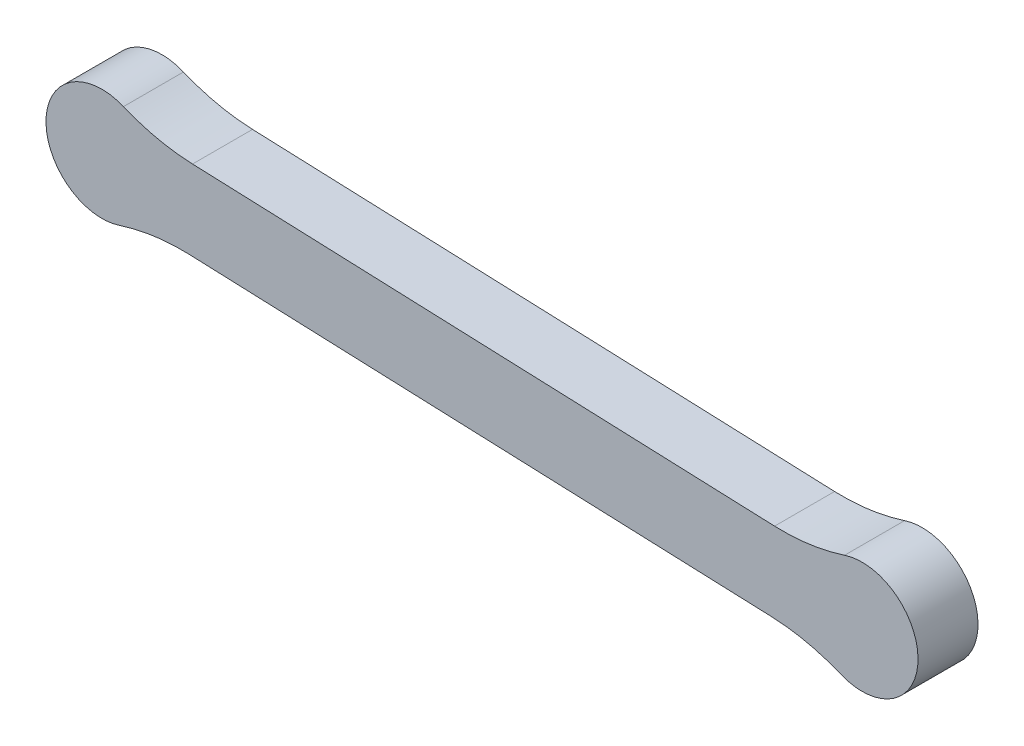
ISO-10303-21;
HEADER;
FILE_DESCRIPTION(('STEP AP214'),'2;1');
FILE_NAME('part.step','',(''),(''),'','','');
FILE_SCHEMA(('AUTOMOTIVE_DESIGN { 1 0 10303 214 1 1 1 1 }'));
ENDSEC;
DATA;
#1=APPLICATION_CONTEXT('core data for automotive mechanical design processes');
#2=APPLICATION_PROTOCOL_DEFINITION('international standard','automotive_design',2000,#1);
#3=PRODUCT_CONTEXT('',#1,'mechanical');
#4=PRODUCT('Part','Part','',(#3));
#5=PRODUCT_RELATED_PRODUCT_CATEGORY('part','',(#4));
#6=PRODUCT_DEFINITION_FORMATION('','',#4);
#7=PRODUCT_DEFINITION_CONTEXT('part definition',#1,'design');
#8=PRODUCT_DEFINITION('design','',#6,#7);
#9=PRODUCT_DEFINITION_SHAPE('','',#8);
#10=(LENGTH_UNIT() NAMED_UNIT(*) SI_UNIT(.MILLI.,.METRE.));
#11=(NAMED_UNIT(*) PLANE_ANGLE_UNIT() SI_UNIT($,.RADIAN.));
#12=(NAMED_UNIT(*) SI_UNIT($,.STERADIAN.) SOLID_ANGLE_UNIT());
#13=UNCERTAINTY_MEASURE_WITH_UNIT(LENGTH_MEASURE(1.E-05),#10,'distance_accuracy_value','');
#14=(GEOMETRIC_REPRESENTATION_CONTEXT(3) GLOBAL_UNCERTAINTY_ASSIGNED_CONTEXT((#13)) GLOBAL_UNIT_ASSIGNED_CONTEXT((#10,
#11,#12)) REPRESENTATION_CONTEXT('',''));
#15=CARTESIAN_POINT('',(0.,0.,0.));
#16=DIRECTION('',(0.,0.,1.));
#17=DIRECTION('',(1.,0.,0.));
#18=AXIS2_PLACEMENT_3D('',#15,#16,#17);
#19=CARTESIAN_POINT('',(-76.2547881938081,492.186778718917,7.50224136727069));
#20=DIRECTION('',(-0.0387465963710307,-0.999249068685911,-3.42595494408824E-12));
#21=DIRECTION('',(0.999249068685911,-0.0387465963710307,0.));
#22=AXIS2_PLACEMENT_3D('',#19,#20,#21);
#23=PLANE('',#22);
#24=DIRECTION('',(-0.999249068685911,0.0387465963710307,-4.54162506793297E-13));
#25=VECTOR('',#24,1.);
#26=CARTESIAN_POINT('',(-76.2547881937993,492.186778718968,-7.49775863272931));
#27=LINE('',#26,#25);
#28=CARTESIAN_POINT('',(91.5390849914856,485.68045143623,-7.49775863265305));
#29=VERTEX_POINT('',#28);
#30=CARTESIAN_POINT('',(-54.0004547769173,491.323851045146,-7.4977586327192));
#31=VERTEX_POINT('',#30);
#32=EDGE_CURVE('E128',#29,#31,#27,.T.);
#33=ORIENTED_EDGE('',*,*,#32,.F.);
#34=DIRECTION('',(5.86565555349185E-13,3.40578503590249E-12,-1.));
#35=VECTOR('',#34,1.);
#36=CARTESIAN_POINT('',(91.5390849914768,485.680451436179,7.50224136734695));
#37=LINE('',#36,#35);
#38=CARTESIAN_POINT('',(91.5390849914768,485.680451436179,7.50224136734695));
#39=VERTEX_POINT('',#38);
#40=EDGE_CURVE('E61',#39,#29,#37,.T.);
#41=ORIENTED_EDGE('',*,*,#40,.F.);
#42=DIRECTION('',(-0.999249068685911,0.0387465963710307,-4.54162506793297E-13));
#43=VECTOR('',#42,1.);
#44=CARTESIAN_POINT('',(-76.2547881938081,492.186778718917,7.50224136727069));
#45=LINE('',#44,#43);
#46=CARTESIAN_POINT('',(-54.0004547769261,491.323851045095,7.5022413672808));
#47=VERTEX_POINT('',#46);
#48=EDGE_CURVE('E106',#39,#47,#45,.T.);
#49=ORIENTED_EDGE('',*,*,#48,.T.);
#50=DIRECTION('',(5.86565555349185E-13,3.40578503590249E-12,-1.));
#51=VECTOR('',#50,1.);
#52=CARTESIAN_POINT('',(-54.0004547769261,491.323851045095,7.5022413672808));
#53=LINE('',#52,#51);
#54=EDGE_CURVE('E11',#47,#31,#53,.T.);
#55=ORIENTED_EDGE('',*,*,#54,.T.);
#56=EDGE_LOOP('',(#33,#41,#49,#55));
#57=FACE_BOUND('',#56,.T.);
#58=ADVANCED_FACE('F16',(#57),#23,.T.);
#59=CARTESIAN_POINT('',(-55.9377845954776,441.361397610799,7.5022413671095));
#60=DIRECTION('',(5.86565555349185E-13,3.40578503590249E-12,-1.));
#61=DIRECTION('',(0.,1.,3.40578503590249E-12));
#62=AXIS2_PLACEMENT_3D('',#59,#60,#61);
#63=CYLINDRICAL_SURFACE('',#62,50.);
#64=CARTESIAN_POINT('',(-55.9377845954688,441.36139761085,-7.49775863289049));
#65=DIRECTION('',(-5.86565555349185E-13,-3.40578503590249E-12,1.));
#66=DIRECTION('',(0.,-1.,-3.40578503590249E-12));
#67=AXIS2_PLACEMENT_3D('',#64,#65,#66);
#68=CIRCLE('',#67,50.);
#69=CARTESIAN_POINT('',(-71.5077358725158,488.875359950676,-7.49775863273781));
#70=VERTEX_POINT('',#69);
#71=EDGE_CURVE('E131',#31,#70,#68,.T.);
#72=ORIENTED_EDGE('',*,*,#71,.F.);
#73=ORIENTED_EDGE('',*,*,#54,.F.);
#74=CARTESIAN_POINT('',(-55.9377845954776,441.361397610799,7.5022413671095));
#75=DIRECTION('',(-5.86565555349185E-13,-3.40578503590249E-12,1.));
#76=DIRECTION('',(0.,-1.,-3.40578503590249E-12));
#77=AXIS2_PLACEMENT_3D('',#74,#75,#76);
#78=CIRCLE('',#77,50.);
#79=CARTESIAN_POINT('',(-71.5077358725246,488.875359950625,7.50224136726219));
#80=VERTEX_POINT('',#79);
#81=EDGE_CURVE('E108',#47,#80,#78,.T.);
#82=ORIENTED_EDGE('',*,*,#81,.T.);
#83=DIRECTION('',(5.86565555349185E-13,3.40578503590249E-12,-1.));
#84=VECTOR('',#83,1.);
#85=CARTESIAN_POINT('',(-71.5077358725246,488.875359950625,7.50224136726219));
#86=LINE('',#85,#84);
#87=EDGE_CURVE('E20',#80,#70,#86,.T.);
#88=ORIENTED_EDGE('',*,*,#87,.T.);
#89=EDGE_LOOP('',(#72,#73,#82,#88));
#90=FACE_BOUND('',#89,.T.);
#91=ADVANCED_FACE('F142',(#90),#63,.F.);
#92=CARTESIAN_POINT('',(-75.8673222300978,502.179269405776,7.50224136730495));
#93=DIRECTION('',(5.86565555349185E-13,3.40578503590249E-12,-1.));
#94=DIRECTION('',(0.,1.,3.40578503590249E-12));
#95=AXIS2_PLACEMENT_3D('',#92,#93,#94);
#96=CYLINDRICAL_SURFACE('',#95,14.);
#97=CARTESIAN_POINT('',(-75.867322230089,502.179269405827,-7.49775863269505));
#98=DIRECTION('',(5.86565555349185E-13,3.40578503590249E-12,-1.));
#99=DIRECTION('',(0.,-1.,-3.40578503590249E-12));
#100=AXIS2_PLACEMENT_3D('',#97,#98,#99);
#101=CIRCLE('',#100,14.);
#102=CARTESIAN_POINT('',(-70.4906377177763,515.105648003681,-7.49775863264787));
#103=VERTEX_POINT('',#102);
#104=EDGE_CURVE('E113',#70,#103,#101,.T.);
#105=ORIENTED_EDGE('',*,*,#104,.F.);
#106=ORIENTED_EDGE('',*,*,#87,.F.);
#107=CARTESIAN_POINT('',(-75.8673222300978,502.179269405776,7.50224136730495));
#108=DIRECTION('',(5.86565555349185E-13,3.40578503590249E-12,-1.));
#109=DIRECTION('',(0.,-1.,-3.40578503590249E-12));
#110=AXIS2_PLACEMENT_3D('',#107,#108,#109);
#111=CIRCLE('',#110,14.);
#112=CARTESIAN_POINT('',(-70.490637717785,515.10564800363,7.50224136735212));
#113=VERTEX_POINT('',#112);
#114=EDGE_CURVE('E133',#80,#113,#111,.T.);
#115=ORIENTED_EDGE('',*,*,#114,.T.);
#116=DIRECTION('',(5.86565555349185E-13,3.40578503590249E-12,-1.));
#117=VECTOR('',#116,1.);
#118=CARTESIAN_POINT('',(-70.490637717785,515.10564800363,7.50224136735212));
#119=LINE('',#118,#117);
#120=EDGE_CURVE('E140',#113,#103,#119,.T.);
#121=ORIENTED_EDGE('',*,*,#120,.T.);
#122=EDGE_LOOP('',(#105,#106,#115,#121));
#123=FACE_BOUND('',#122,.T.);
#124=ADVANCED_FACE('F18',(#123),#96,.T.);
#125=CARTESIAN_POINT('',(-51.2881930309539,561.271285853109,7.50224136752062));
#126=DIRECTION('',(5.86565555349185E-13,3.40578503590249E-12,-1.));
#127=DIRECTION('',(0.,1.,3.40578503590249E-12));
#128=AXIS2_PLACEMENT_3D('',#125,#126,#127);
#129=CYLINDRICAL_SURFACE('',#128,50.);
#130=CARTESIAN_POINT('',(-51.2881930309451,561.27128585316,-7.49775863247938));
#131=DIRECTION('',(-5.86565555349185E-13,-3.40578503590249E-12,1.));
#132=DIRECTION('',(0.,-1.,-3.40578503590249E-12));
#133=AXIS2_PLACEMENT_3D('',#130,#131,#132);
#134=CIRCLE('',#133,50.);
#135=CARTESIAN_POINT('',(-53.2255228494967,511.308832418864,-7.49775863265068));
#136=VERTEX_POINT('',#135);
#137=EDGE_CURVE('E116',#103,#136,#134,.T.);
#138=ORIENTED_EDGE('',*,*,#137,.F.);
#139=ORIENTED_EDGE('',*,*,#120,.F.);
#140=CARTESIAN_POINT('',(-51.2881930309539,561.271285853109,7.50224136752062));
#141=DIRECTION('',(-5.86565555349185E-13,-3.40578503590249E-12,1.));
#142=DIRECTION('',(0.,-1.,-3.40578503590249E-12));
#143=AXIS2_PLACEMENT_3D('',#140,#141,#142);
#144=CIRCLE('',#143,50.);
#145=CARTESIAN_POINT('',(-53.2255228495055,511.308832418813,7.50224136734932));
#146=VERTEX_POINT('',#145);
#147=EDGE_CURVE('E178',#113,#146,#144,.T.);
#148=ORIENTED_EDGE('',*,*,#147,.T.);
#149=DIRECTION('',(5.86565555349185E-13,3.40578503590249E-12,-1.));
#150=VECTOR('',#149,1.);
#151=CARTESIAN_POINT('',(-53.2255228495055,511.308832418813,7.50224136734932));
#152=LINE('',#151,#150);
#153=EDGE_CURVE('E139',#146,#136,#152,.T.);
#154=ORIENTED_EDGE('',*,*,#153,.T.);
#155=EDGE_LOOP('',(#138,#139,#148,#154));
#156=FACE_BOUND('',#155,.T.);
#157=ADVANCED_FACE('F165',(#156),#129,.F.);
#158=CARTESIAN_POINT('',(-75.4798562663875,512.171760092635,7.50224136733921));
#159=DIRECTION('',(0.0387465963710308,0.999249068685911,3.42595494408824E-12));
#160=DIRECTION('',(-0.999249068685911,0.0387465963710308,0.));
#161=AXIS2_PLACEMENT_3D('',#158,#159,#160);
#162=PLANE('',#161);
#163=DIRECTION('',(0.999249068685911,-0.0387465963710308,4.54162506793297E-13));
#164=VECTOR('',#163,1.);
#165=CARTESIAN_POINT('',(-75.4798562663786,512.171760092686,-7.49775863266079));
#166=LINE('',#165,#164);
#167=CARTESIAN_POINT('',(92.3140169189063,505.665432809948,-7.49775863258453));
#168=VERTEX_POINT('',#167);
#169=EDGE_CURVE('E119',#136,#168,#166,.T.);
#170=ORIENTED_EDGE('',*,*,#169,.F.);
#171=ORIENTED_EDGE('',*,*,#153,.F.);
#172=DIRECTION('',(0.999249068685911,-0.0387465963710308,4.54162506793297E-13));
#173=VECTOR('',#172,1.);
#174=CARTESIAN_POINT('',(-75.4798562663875,512.171760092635,7.50224136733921));
#175=LINE('',#174,#173);
#176=CARTESIAN_POINT('',(92.3140169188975,505.665432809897,7.50224136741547));
#177=VERTEX_POINT('',#176);
#178=EDGE_CURVE('E177',#146,#177,#175,.T.);
#179=ORIENTED_EDGE('',*,*,#178,.T.);
#180=DIRECTION('',(5.86565555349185E-13,3.40578503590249E-12,-1.));
#181=VECTOR('',#180,1.);
#182=CARTESIAN_POINT('',(92.3140169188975,505.665432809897,7.50224136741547));
#183=LINE('',#182,#181);
#184=EDGE_CURVE('E137',#177,#168,#183,.T.);
#185=ORIENTED_EDGE('',*,*,#184,.T.);
#186=EDGE_LOOP('',(#170,#171,#179,#185));
#187=FACE_BOUND('',#186,.T.);
#188=ADVANCED_FACE('F162',(#187),#162,.T.);
#189=CARTESIAN_POINT('',(94.251346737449,555.627886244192,7.50224136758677));
#190=DIRECTION('',(5.86565555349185E-13,3.40578503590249E-12,-1.));
#191=DIRECTION('',(0.,1.,3.40578503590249E-12));
#192=AXIS2_PLACEMENT_3D('',#189,#190,#191);
#193=CYLINDRICAL_SURFACE('',#192,50.);
#194=CARTESIAN_POINT('',(94.2513467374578,555.627886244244,-7.49775863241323));
#195=DIRECTION('',(-5.86565555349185E-13,-3.40578503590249E-12,1.));
#196=DIRECTION('',(0.,-1.,-3.40578503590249E-12));
#197=AXIS2_PLACEMENT_3D('',#194,#195,#196);
#198=CIRCLE('',#197,50.);
#199=CARTESIAN_POINT('',(109.821298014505,508.113923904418,-7.49775863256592));
#200=VERTEX_POINT('',#199);
#201=EDGE_CURVE('E122',#168,#200,#198,.T.);
#202=ORIENTED_EDGE('',*,*,#201,.F.);
#203=ORIENTED_EDGE('',*,*,#184,.F.);
#204=CARTESIAN_POINT('',(94.251346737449,555.627886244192,7.50224136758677));
#205=DIRECTION('',(-5.86565555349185E-13,-3.40578503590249E-12,1.));
#206=DIRECTION('',(0.,-1.,-3.40578503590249E-12));
#207=AXIS2_PLACEMENT_3D('',#204,#205,#206);
#208=CIRCLE('',#207,50.);
#209=CARTESIAN_POINT('',(109.821298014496,508.113923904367,7.50224136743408));
#210=VERTEX_POINT('',#209);
#211=EDGE_CURVE('E103',#177,#210,#208,.T.);
#212=ORIENTED_EDGE('',*,*,#211,.T.);
#213=DIRECTION('',(5.86565555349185E-13,3.40578503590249E-12,-1.));
#214=VECTOR('',#213,1.);
#215=CARTESIAN_POINT('',(109.821298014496,508.113923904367,7.50224136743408));
#216=LINE('',#215,#214);
#217=EDGE_CURVE('E95',#210,#200,#216,.T.);
#218=ORIENTED_EDGE('',*,*,#217,.T.);
#219=EDGE_LOOP('',(#202,#203,#212,#218));
#220=FACE_BOUND('',#219,.T.);
#221=ADVANCED_FACE('F159',(#220),#193,.F.);
#222=CARTESIAN_POINT('',(114.180884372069,494.810014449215,7.50224136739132));
#223=DIRECTION('',(5.86565555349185E-13,3.40578503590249E-12,-1.));
#224=DIRECTION('',(0.,1.,3.40578503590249E-12));
#225=AXIS2_PLACEMENT_3D('',#222,#223,#224);
#226=CYLINDRICAL_SURFACE('',#225,14.);
#227=CARTESIAN_POINT('',(114.180884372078,494.810014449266,-7.49775863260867));
#228=DIRECTION('',(5.86565555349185E-13,3.40578503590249E-12,-1.));
#229=DIRECTION('',(0.,-1.,-3.40578503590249E-12));
#230=AXIS2_PLACEMENT_3D('',#227,#228,#229);
#231=CIRCLE('',#230,14.);
#232=CARTESIAN_POINT('',(108.804199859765,481.883635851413,-7.49775863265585));
#233=VERTEX_POINT('',#232);
#234=EDGE_CURVE('E125',#200,#233,#231,.T.);
#235=ORIENTED_EDGE('',*,*,#234,.F.);
#236=ORIENTED_EDGE('',*,*,#217,.F.);
#237=CARTESIAN_POINT('',(114.180884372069,494.810014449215,7.50224136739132));
#238=DIRECTION('',(5.86565555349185E-13,3.40578503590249E-12,-1.));
#239=DIRECTION('',(0.,-1.,-3.40578503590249E-12));
#240=AXIS2_PLACEMENT_3D('',#237,#238,#239);
#241=CIRCLE('',#240,14.);
#242=CARTESIAN_POINT('',(108.804199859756,481.883635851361,7.50224136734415));
#243=VERTEX_POINT('',#242);
#244=EDGE_CURVE('E98',#210,#243,#241,.T.);
#245=ORIENTED_EDGE('',*,*,#244,.T.);
#246=DIRECTION('',(5.86565555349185E-13,3.40578503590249E-12,-1.));
#247=VECTOR('',#246,1.);
#248=CARTESIAN_POINT('',(108.804199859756,481.883635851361,7.50224136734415));
#249=LINE('',#248,#247);
#250=EDGE_CURVE('E85',#243,#233,#249,.T.);
#251=ORIENTED_EDGE('',*,*,#250,.T.);
#252=EDGE_LOOP('',(#235,#236,#245,#251));
#253=FACE_BOUND('',#252,.T.);
#254=ADVANCED_FACE('F99',(#253),#226,.T.);
#255=CARTESIAN_POINT('',(89.6017551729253,435.717998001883,7.50224136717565));
#256=DIRECTION('',(5.86565555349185E-13,3.40578503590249E-12,-1.));
#257=DIRECTION('',(0.,1.,3.40578503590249E-12));
#258=AXIS2_PLACEMENT_3D('',#255,#256,#257);
#259=CYLINDRICAL_SURFACE('',#258,50.);
#260=CARTESIAN_POINT('',(89.6017551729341,435.717998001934,-7.49775863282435));
#261=DIRECTION('',(-5.86565555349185E-13,-3.40578503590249E-12,1.));
#262=DIRECTION('',(0.,-1.,-3.40578503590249E-12));
#263=AXIS2_PLACEMENT_3D('',#260,#261,#262);
#264=CIRCLE('',#263,50.);
#265=EDGE_CURVE('E91',#233,#29,#264,.T.);
#266=ORIENTED_EDGE('',*,*,#265,.F.);
#267=ORIENTED_EDGE('',*,*,#250,.F.);
#268=CARTESIAN_POINT('',(89.6017551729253,435.717998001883,7.50224136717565));
#269=DIRECTION('',(-5.86565555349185E-13,-3.40578503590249E-12,1.));
#270=DIRECTION('',(0.,-1.,-3.40578503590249E-12));
#271=AXIS2_PLACEMENT_3D('',#268,#269,#270);
#272=CIRCLE('',#271,50.);
#273=EDGE_CURVE('E89',#243,#39,#272,.T.);
#274=ORIENTED_EDGE('',*,*,#273,.T.);
#275=ORIENTED_EDGE('',*,*,#40,.T.);
#276=EDGE_LOOP('',(#266,#267,#274,#275));
#277=FACE_BOUND('',#276,.T.);
#278=ADVANCED_FACE('F87',(#277),#259,.F.);
#279=CARTESIAN_POINT('',(19.1567810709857,498.494641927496,7.50224136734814));
#280=DIRECTION('',(5.8656874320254E-13,3.40578555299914E-12,-1.));
#281=DIRECTION('',(0.,1.,3.40578555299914E-12));
#282=AXIS2_PLACEMENT_3D('',#279,#280,#281);
#283=PLANE('',#282);
#284=ORIENTED_EDGE('',*,*,#48,.F.);
#285=ORIENTED_EDGE('',*,*,#273,.F.);
#286=ORIENTED_EDGE('',*,*,#244,.F.);
#287=ORIENTED_EDGE('',*,*,#211,.F.);
#288=ORIENTED_EDGE('',*,*,#178,.F.);
#289=ORIENTED_EDGE('',*,*,#147,.F.);
#290=ORIENTED_EDGE('',*,*,#114,.F.);
#291=ORIENTED_EDGE('',*,*,#81,.F.);
#292=EDGE_LOOP('',(#284,#285,#286,#287,#288,#289,#290,#291));
#293=FACE_BOUND('',#292,.T.);
#294=ADVANCED_FACE('F105',(#293),#283,.F.);
#295=CARTESIAN_POINT('',(19.1567810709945,498.494641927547,-7.49775863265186));
#296=DIRECTION('',(5.8656874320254E-13,3.40578555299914E-12,-1.));
#297=DIRECTION('',(0.,1.,3.40578555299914E-12));
#298=AXIS2_PLACEMENT_3D('',#295,#296,#297);
#299=PLANE('',#298);
#300=ORIENTED_EDGE('',*,*,#32,.T.);
#301=ORIENTED_EDGE('',*,*,#71,.T.);
#302=ORIENTED_EDGE('',*,*,#104,.T.);
#303=ORIENTED_EDGE('',*,*,#137,.T.);
#304=ORIENTED_EDGE('',*,*,#169,.T.);
#305=ORIENTED_EDGE('',*,*,#201,.T.);
#306=ORIENTED_EDGE('',*,*,#234,.T.);
#307=ORIENTED_EDGE('',*,*,#265,.T.);
#308=EDGE_LOOP('',(#300,#301,#302,#303,#304,#305,#306,#307));
#309=FACE_BOUND('',#308,.T.);
#310=ADVANCED_FACE('F145',(#309),#299,.T.);
#311=CLOSED_SHELL('',(#58,#91,#124,#157,#188,#221,#254,#278,#294,#310));
#312=MANIFOLD_SOLID_BREP('B1',#311);
#313=ADVANCED_BREP_SHAPE_REPRESENTATION('',(#18,#312),#14);
#314=SHAPE_DEFINITION_REPRESENTATION(#9,#313);
ENDSEC;
END-ISO-10303-21;
